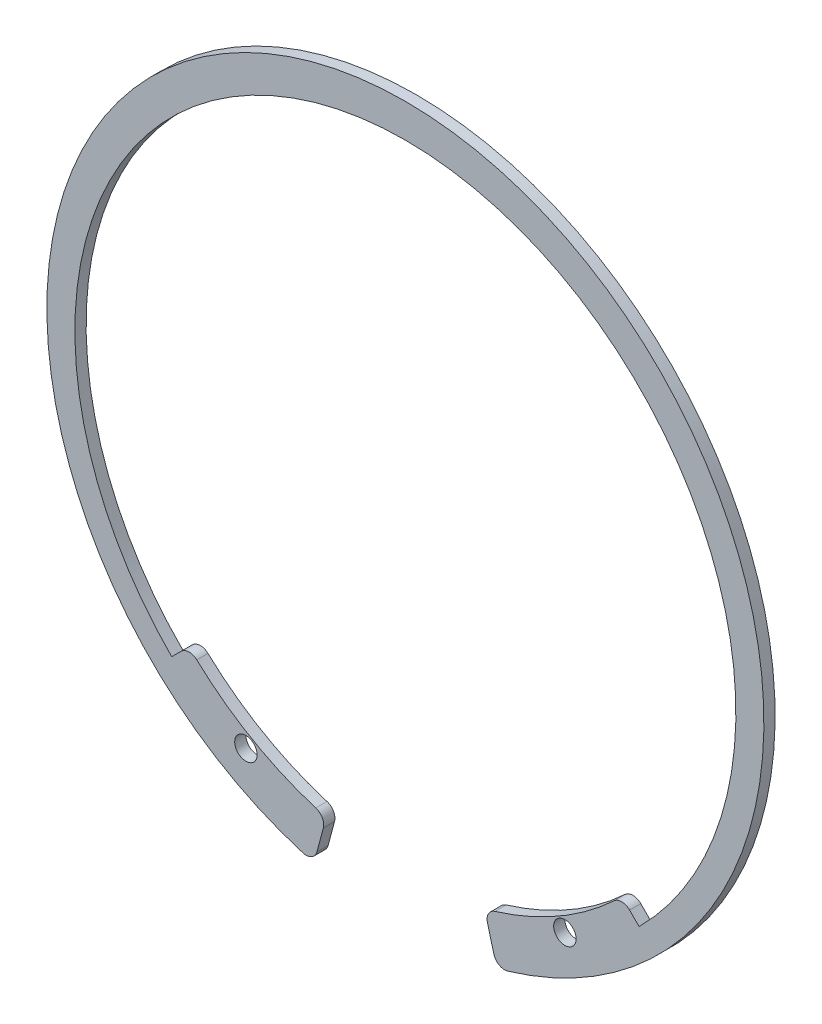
ISO-10303-21;
HEADER;
FILE_DESCRIPTION(('STEP AP214'),'2;1');
FILE_NAME('part.step','',(''),(''),'','','');
FILE_SCHEMA(('AUTOMOTIVE_DESIGN { 1 0 10303 214 1 1 1 1 }'));
ENDSEC;
DATA;
#1=APPLICATION_CONTEXT('core data for automotive mechanical design processes');
#2=APPLICATION_PROTOCOL_DEFINITION('international standard','automotive_design',2000,#1);
#3=PRODUCT_CONTEXT('',#1,'mechanical');
#4=PRODUCT('Part','Part','',(#3));
#5=PRODUCT_RELATED_PRODUCT_CATEGORY('part','',(#4));
#6=PRODUCT_DEFINITION_FORMATION('','',#4);
#7=PRODUCT_DEFINITION_CONTEXT('part definition',#1,'design');
#8=PRODUCT_DEFINITION('design','',#6,#7);
#9=PRODUCT_DEFINITION_SHAPE('','',#8);
#10=(LENGTH_UNIT() NAMED_UNIT(*) SI_UNIT(.MILLI.,.METRE.));
#11=(NAMED_UNIT(*) PLANE_ANGLE_UNIT() SI_UNIT($,.RADIAN.));
#12=(NAMED_UNIT(*) SI_UNIT($,.STERADIAN.) SOLID_ANGLE_UNIT());
#13=UNCERTAINTY_MEASURE_WITH_UNIT(LENGTH_MEASURE(1.E-05),#10,'distance_accuracy_value','');
#14=(GEOMETRIC_REPRESENTATION_CONTEXT(3) GLOBAL_UNCERTAINTY_ASSIGNED_CONTEXT((#13)) GLOBAL_UNIT_ASSIGNED_CONTEXT((#10,
#11,#12)) REPRESENTATION_CONTEXT('',''));
#15=CARTESIAN_POINT('',(0.,0.,0.));
#16=DIRECTION('',(0.,0.,1.));
#17=DIRECTION('',(1.,0.,0.));
#18=AXIS2_PLACEMENT_3D('',#15,#16,#17);
#19=CARTESIAN_POINT('',(19.3033875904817,-20.7176011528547,1.));
#20=DIRECTION('',(0.,0.,-1.));
#21=DIRECTION('',(-1.,0.,0.));
#22=AXIS2_PLACEMENT_3D('',#19,#20,#21);
#23=PLANE('',#22);
#24=CARTESIAN_POINT('',(-14.2347187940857,-24.6298818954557,1.));
#25=DIRECTION('',(0.,0.,1.));
#26=DIRECTION('',(1.,0.,0.));
#27=AXIS2_PLACEMENT_3D('',#24,#25,#26);
#28=CIRCLE('',#27,1.);
#29=CARTESIAN_POINT('',(-13.2347187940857,-24.6298818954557,1.));
#30=VERTEX_POINT('',#29);
#31=EDGE_CURVE('E149',#30,#30,#28,.T.);
#32=ORIENTED_EDGE('',*,*,#31,.F.);
#33=EDGE_LOOP('',(#32));
#34=FACE_BOUND('',#33,.T.);
#35=CARTESIAN_POINT('',(19.3033875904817,-20.7176011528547,1.));
#36=DIRECTION('',(0.,0.,1.));
#37=DIRECTION('',(-1.,0.,0.));
#38=AXIS2_PLACEMENT_3D('',#35,#36,#37);
#39=CIRCLE('',#38,0.999999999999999);
#40=CARTESIAN_POINT('',(20.0104943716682,-20.0104943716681,1.));
#41=VERTEX_POINT('',#40);
#42=CARTESIAN_POINT('',(18.6216931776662,-19.9859641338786,1.));
#43=VERTEX_POINT('',#42);
#44=EDGE_CURVE('E179',#41,#43,#39,.T.);
#45=ORIENTED_EDGE('',*,*,#44,.T.);
#46=CARTESIAN_POINT('',(0.,0.,1.));
#47=DIRECTION('',(0.,0.,-1.));
#48=DIRECTION('',(1.,0.,0.));
#49=AXIS2_PLACEMENT_3D('',#46,#47,#48);
#50=CIRCLE('',#49,27.3167754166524);
#51=CARTESIAN_POINT('',(7.99750607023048,-26.1198414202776,1.));
#52=VERTEX_POINT('',#51);
#53=EDGE_CURVE('E144',#43,#52,#50,.T.);
#54=ORIENTED_EDGE('',*,*,#53,.T.);
#55=CARTESIAN_POINT('',(8.29027510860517,-27.0760246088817,1.));
#56=DIRECTION('',(0.,0.,1.));
#57=DIRECTION('',(-1.,0.,0.));
#58=AXIS2_PLACEMENT_3D('',#55,#56,#57);
#59=CIRCLE('',#58,1.);
#60=CARTESIAN_POINT('',(7.3243492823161,-27.3348436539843,1.));
#61=VERTEX_POINT('',#60);
#62=EDGE_CURVE('E182',#52,#61,#59,.T.);
#63=ORIENTED_EDGE('',*,*,#62,.T.);
#64=DIRECTION('',(0.258819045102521,-0.965925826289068,0.));
#65=VECTOR('',#64,1.);
#66=CARTESIAN_POINT('',(7.8952258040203,-29.4653838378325,1.));
#67=LINE('',#66,#65);
#68=CARTESIAN_POINT('',(7.8952258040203,-29.4653838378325,1.));
#69=VERTEX_POINT('',#68);
#70=EDGE_CURVE('E184',#61,#69,#67,.T.);
#71=ORIENTED_EDGE('',*,*,#70,.T.);
#72=CARTESIAN_POINT('',(8.86115163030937,-29.20656479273,1.));
#73=DIRECTION('',(0.,0.,1.));
#74=DIRECTION('',(-1.,0.,0.));
#75=AXIS2_PLACEMENT_3D('',#72,#73,#74);
#76=CIRCLE('',#75,1.);
#77=CARTESIAN_POINT('',(9.14699523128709,-30.1648410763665,1.));
#78=VERTEX_POINT('',#77);
#79=EDGE_CURVE('E186',#69,#78,#76,.T.);
#80=ORIENTED_EDGE('',*,*,#79,.T.);
#81=CARTESIAN_POINT('',(0.,0.5,1.));
#82=DIRECTION('',(0.,0.,1.));
#83=DIRECTION('',(1.,0.,0.));
#84=AXIS2_PLACEMENT_3D('',#81,#82,#83);
#85=CIRCLE('',#84,32.);
#86=CARTESIAN_POINT('',(-9.14699523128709,-30.1648410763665,1.));
#87=VERTEX_POINT('',#86);
#88=EDGE_CURVE('E188',#78,#87,#85,.T.);
#89=ORIENTED_EDGE('',*,*,#88,.T.);
#90=CARTESIAN_POINT('',(-8.86115163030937,-29.20656479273,1.));
#91=DIRECTION('',(0.,0.,1.));
#92=DIRECTION('',(1.,0.,0.));
#93=AXIS2_PLACEMENT_3D('',#90,#91,#92);
#94=CIRCLE('',#93,1.);
#95=CARTESIAN_POINT('',(-7.8952258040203,-29.4653838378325,1.));
#96=VERTEX_POINT('',#95);
#97=EDGE_CURVE('E190',#87,#96,#94,.T.);
#98=ORIENTED_EDGE('',*,*,#97,.T.);
#99=DIRECTION('',(0.258819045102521,0.965925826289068,0.));
#100=VECTOR('',#99,1.);
#101=CARTESIAN_POINT('',(-7.8952258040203,-29.4653838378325,1.));
#102=LINE('',#101,#100);
#103=CARTESIAN_POINT('',(-7.3243492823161,-27.3348436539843,1.));
#104=VERTEX_POINT('',#103);
#105=EDGE_CURVE('E192',#96,#104,#102,.T.);
#106=ORIENTED_EDGE('',*,*,#105,.T.);
#107=CARTESIAN_POINT('',(-8.29027510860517,-27.0760246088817,1.));
#108=DIRECTION('',(0.,0.,1.));
#109=DIRECTION('',(1.,0.,0.));
#110=AXIS2_PLACEMENT_3D('',#107,#108,#109);
#111=CIRCLE('',#110,1.);
#112=CARTESIAN_POINT('',(-7.99750607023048,-26.1198414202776,1.));
#113=VERTEX_POINT('',#112);
#114=EDGE_CURVE('E194',#104,#113,#111,.T.);
#115=ORIENTED_EDGE('',*,*,#114,.T.);
#116=CARTESIAN_POINT('',(0.,0.,1.));
#117=DIRECTION('',(0.,0.,-1.));
#118=DIRECTION('',(1.,0.,0.));
#119=AXIS2_PLACEMENT_3D('',#116,#117,#118);
#120=CIRCLE('',#119,27.3167754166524);
#121=CARTESIAN_POINT('',(-18.6216931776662,-19.9859641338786,1.));
#122=VERTEX_POINT('',#121);
#123=EDGE_CURVE('E196',#113,#122,#120,.T.);
#124=ORIENTED_EDGE('',*,*,#123,.T.);
#125=CARTESIAN_POINT('',(-19.3033875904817,-20.7176011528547,1.));
#126=DIRECTION('',(0.,0.,1.));
#127=DIRECTION('',(-1.,0.,0.));
#128=AXIS2_PLACEMENT_3D('',#125,#126,#127);
#129=CIRCLE('',#128,1.);
#130=CARTESIAN_POINT('',(-20.0104943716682,-20.0104943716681,1.));
#131=VERTEX_POINT('',#130);
#132=EDGE_CURVE('E198',#122,#131,#129,.T.);
#133=ORIENTED_EDGE('',*,*,#132,.T.);
#134=DIRECTION('',(-0.707106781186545,-0.70710678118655,0.));
#135=VECTOR('',#134,1.);
#136=CARTESIAN_POINT('',(-20.0104943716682,-20.0104943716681,1.));
#137=LINE('',#136,#135);
#138=CARTESIAN_POINT('',(-20.8596500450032,-20.8596500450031,1.));
#139=VERTEX_POINT('',#138);
#140=EDGE_CURVE('E200',#131,#139,#137,.T.);
#141=ORIENTED_EDGE('',*,*,#140,.T.);
#142=CARTESIAN_POINT('',(0.,0.,1.));
#143=DIRECTION('',(0.,0.,-1.));
#144=DIRECTION('',(1.,0.,0.));
#145=AXIS2_PLACEMENT_3D('',#142,#143,#144);
#146=CIRCLE('',#145,29.5);
#147=CARTESIAN_POINT('',(20.8596500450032,-20.8596500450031,1.));
#148=VERTEX_POINT('',#147);
#149=EDGE_CURVE('E49',#139,#148,#146,.T.);
#150=ORIENTED_EDGE('',*,*,#149,.T.);
#151=DIRECTION('',(-0.707106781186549,0.707106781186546,0.));
#152=VECTOR('',#151,1.);
#153=CARTESIAN_POINT('',(20.0104943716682,-20.0104943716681,1.));
#154=LINE('',#153,#152);
#155=EDGE_CURVE('E44',#148,#41,#154,.T.);
#156=ORIENTED_EDGE('',*,*,#155,.T.);
#157=EDGE_LOOP('',(#45,#54,#63,#71,#80,#89,#98,#106,#115,#124,#133,#141,#150,#156));
#158=FACE_BOUND('',#157,.T.);
#159=CARTESIAN_POINT('',(14.2347187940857,-24.6298818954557,1.));
#160=DIRECTION('',(0.,0.,1.));
#161=DIRECTION('',(-1.,0.,0.));
#162=AXIS2_PLACEMENT_3D('',#159,#160,#161);
#163=CIRCLE('',#162,1.);
#164=CARTESIAN_POINT('',(13.2347187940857,-24.6298818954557,1.));
#165=VERTEX_POINT('',#164);
#166=EDGE_CURVE('E319',#165,#165,#163,.T.);
#167=ORIENTED_EDGE('',*,*,#166,.F.);
#168=EDGE_LOOP('',(#167));
#169=FACE_BOUND('',#168,.T.);
#170=ADVANCED_FACE('F29',(#34,#158,#169),#23,.F.);
#171=CARTESIAN_POINT('',(19.3033875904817,-20.7176011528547,0.));
#172=DIRECTION('',(0.,0.,-1.));
#173=DIRECTION('',(-1.,0.,0.));
#174=AXIS2_PLACEMENT_3D('',#171,#172,#173);
#175=PLANE('',#174);
#176=CARTESIAN_POINT('',(-14.2347187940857,-24.6298818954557,0.));
#177=DIRECTION('',(0.,0.,1.));
#178=DIRECTION('',(1.,0.,0.));
#179=AXIS2_PLACEMENT_3D('',#176,#177,#178);
#180=CIRCLE('',#179,1.);
#181=CARTESIAN_POINT('',(-13.2347187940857,-24.6298818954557,0.));
#182=VERTEX_POINT('',#181);
#183=EDGE_CURVE('E152',#182,#182,#180,.T.);
#184=ORIENTED_EDGE('',*,*,#183,.T.);
#185=EDGE_LOOP('',(#184));
#186=FACE_BOUND('',#185,.T.);
#187=CARTESIAN_POINT('',(19.3033875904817,-20.7176011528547,0.));
#188=DIRECTION('',(0.,0.,1.));
#189=DIRECTION('',(-1.,0.,0.));
#190=AXIS2_PLACEMENT_3D('',#187,#188,#189);
#191=CIRCLE('',#190,0.999999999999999);
#192=CARTESIAN_POINT('',(20.0104943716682,-20.0104943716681,0.));
#193=VERTEX_POINT('',#192);
#194=CARTESIAN_POINT('',(18.6216931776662,-19.9859641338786,0.));
#195=VERTEX_POINT('',#194);
#196=EDGE_CURVE('E135',#193,#195,#191,.T.);
#197=ORIENTED_EDGE('',*,*,#196,.F.);
#198=DIRECTION('',(-0.707106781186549,0.707106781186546,0.));
#199=VECTOR('',#198,1.);
#200=CARTESIAN_POINT('',(20.0104943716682,-20.0104943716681,0.));
#201=LINE('',#200,#199);
#202=CARTESIAN_POINT('',(20.8596500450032,-20.8596500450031,0.));
#203=VERTEX_POINT('',#202);
#204=EDGE_CURVE('E177',#203,#193,#201,.T.);
#205=ORIENTED_EDGE('',*,*,#204,.F.);
#206=CARTESIAN_POINT('',(0.,0.,0.));
#207=DIRECTION('',(0.,0.,-1.));
#208=DIRECTION('',(1.,0.,0.));
#209=AXIS2_PLACEMENT_3D('',#206,#207,#208);
#210=CIRCLE('',#209,29.5);
#211=CARTESIAN_POINT('',(-20.8596500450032,-20.8596500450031,0.));
#212=VERTEX_POINT('',#211);
#213=EDGE_CURVE('E175',#212,#203,#210,.T.);
#214=ORIENTED_EDGE('',*,*,#213,.F.);
#215=DIRECTION('',(-0.707106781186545,-0.70710678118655,0.));
#216=VECTOR('',#215,1.);
#217=CARTESIAN_POINT('',(-20.0104943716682,-20.0104943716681,0.));
#218=LINE('',#217,#216);
#219=CARTESIAN_POINT('',(-20.0104943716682,-20.0104943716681,0.));
#220=VERTEX_POINT('',#219);
#221=EDGE_CURVE('E173',#220,#212,#218,.T.);
#222=ORIENTED_EDGE('',*,*,#221,.F.);
#223=CARTESIAN_POINT('',(-19.3033875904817,-20.7176011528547,0.));
#224=DIRECTION('',(0.,0.,1.));
#225=DIRECTION('',(-1.,0.,0.));
#226=AXIS2_PLACEMENT_3D('',#223,#224,#225);
#227=CIRCLE('',#226,1.);
#228=CARTESIAN_POINT('',(-18.6216931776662,-19.9859641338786,0.));
#229=VERTEX_POINT('',#228);
#230=EDGE_CURVE('E171',#229,#220,#227,.T.);
#231=ORIENTED_EDGE('',*,*,#230,.F.);
#232=CARTESIAN_POINT('',(0.,0.,0.));
#233=DIRECTION('',(0.,0.,-1.));
#234=DIRECTION('',(1.,0.,0.));
#235=AXIS2_PLACEMENT_3D('',#232,#233,#234);
#236=CIRCLE('',#235,27.3167754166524);
#237=CARTESIAN_POINT('',(-7.99750607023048,-26.1198414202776,0.));
#238=VERTEX_POINT('',#237);
#239=EDGE_CURVE('E169',#238,#229,#236,.T.);
#240=ORIENTED_EDGE('',*,*,#239,.F.);
#241=CARTESIAN_POINT('',(-8.29027510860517,-27.0760246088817,0.));
#242=DIRECTION('',(0.,0.,1.));
#243=DIRECTION('',(1.,0.,0.));
#244=AXIS2_PLACEMENT_3D('',#241,#242,#243);
#245=CIRCLE('',#244,1.);
#246=CARTESIAN_POINT('',(-7.3243492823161,-27.3348436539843,0.));
#247=VERTEX_POINT('',#246);
#248=EDGE_CURVE('E167',#247,#238,#245,.T.);
#249=ORIENTED_EDGE('',*,*,#248,.F.);
#250=DIRECTION('',(0.258819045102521,0.965925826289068,0.));
#251=VECTOR('',#250,1.);
#252=CARTESIAN_POINT('',(-7.8952258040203,-29.4653838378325,0.));
#253=LINE('',#252,#251);
#254=CARTESIAN_POINT('',(-7.8952258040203,-29.4653838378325,0.));
#255=VERTEX_POINT('',#254);
#256=EDGE_CURVE('E165',#255,#247,#253,.T.);
#257=ORIENTED_EDGE('',*,*,#256,.F.);
#258=CARTESIAN_POINT('',(-8.86115163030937,-29.20656479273,0.));
#259=DIRECTION('',(0.,0.,1.));
#260=DIRECTION('',(1.,0.,0.));
#261=AXIS2_PLACEMENT_3D('',#258,#259,#260);
#262=CIRCLE('',#261,1.);
#263=CARTESIAN_POINT('',(-9.14699523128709,-30.1648410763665,0.));
#264=VERTEX_POINT('',#263);
#265=EDGE_CURVE('E163',#264,#255,#262,.T.);
#266=ORIENTED_EDGE('',*,*,#265,.F.);
#267=CARTESIAN_POINT('',(0.,0.5,0.));
#268=DIRECTION('',(0.,0.,1.));
#269=DIRECTION('',(1.,0.,0.));
#270=AXIS2_PLACEMENT_3D('',#267,#268,#269);
#271=CIRCLE('',#270,32.);
#272=CARTESIAN_POINT('',(9.14699523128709,-30.1648410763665,0.));
#273=VERTEX_POINT('',#272);
#274=EDGE_CURVE('E161',#273,#264,#271,.T.);
#275=ORIENTED_EDGE('',*,*,#274,.F.);
#276=CARTESIAN_POINT('',(8.86115163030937,-29.20656479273,0.));
#277=DIRECTION('',(0.,0.,1.));
#278=DIRECTION('',(-1.,0.,0.));
#279=AXIS2_PLACEMENT_3D('',#276,#277,#278);
#280=CIRCLE('',#279,1.);
#281=CARTESIAN_POINT('',(7.8952258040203,-29.4653838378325,0.));
#282=VERTEX_POINT('',#281);
#283=EDGE_CURVE('E159',#282,#273,#280,.T.);
#284=ORIENTED_EDGE('',*,*,#283,.F.);
#285=DIRECTION('',(0.258819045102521,-0.965925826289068,0.));
#286=VECTOR('',#285,1.);
#287=CARTESIAN_POINT('',(7.8952258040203,-29.4653838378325,0.));
#288=LINE('',#287,#286);
#289=CARTESIAN_POINT('',(7.3243492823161,-27.3348436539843,0.));
#290=VERTEX_POINT('',#289);
#291=EDGE_CURVE('E157',#290,#282,#288,.T.);
#292=ORIENTED_EDGE('',*,*,#291,.F.);
#293=CARTESIAN_POINT('',(8.29027510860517,-27.0760246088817,0.));
#294=DIRECTION('',(0.,0.,1.));
#295=DIRECTION('',(-1.,0.,0.));
#296=AXIS2_PLACEMENT_3D('',#293,#294,#295);
#297=CIRCLE('',#296,1.);
#298=CARTESIAN_POINT('',(7.99750607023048,-26.1198414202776,0.));
#299=VERTEX_POINT('',#298);
#300=EDGE_CURVE('E137',#299,#290,#297,.T.);
#301=ORIENTED_EDGE('',*,*,#300,.F.);
#302=CARTESIAN_POINT('',(0.,0.,0.));
#303=DIRECTION('',(0.,0.,-1.));
#304=DIRECTION('',(1.,0.,0.));
#305=AXIS2_PLACEMENT_3D('',#302,#303,#304);
#306=CIRCLE('',#305,27.3167754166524);
#307=EDGE_CURVE('E130',#195,#299,#306,.T.);
#308=ORIENTED_EDGE('',*,*,#307,.F.);
#309=EDGE_LOOP('',(#197,#205,#214,#222,#231,#240,#249,#257,#266,#275,#284,#292,#301,#308));
#310=FACE_BOUND('',#309,.T.);
#311=CARTESIAN_POINT('',(14.2347187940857,-24.6298818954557,0.));
#312=DIRECTION('',(0.,0.,1.));
#313=DIRECTION('',(-1.,0.,0.));
#314=AXIS2_PLACEMENT_3D('',#311,#312,#313);
#315=CIRCLE('',#314,1.);
#316=CARTESIAN_POINT('',(13.2347187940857,-24.6298818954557,0.));
#317=VERTEX_POINT('',#316);
#318=EDGE_CURVE('E322',#317,#317,#315,.T.);
#319=ORIENTED_EDGE('',*,*,#318,.T.);
#320=EDGE_LOOP('',(#319));
#321=FACE_BOUND('',#320,.T.);
#322=ADVANCED_FACE('F131',(#186,#310,#321),#175,.T.);
#323=CARTESIAN_POINT('',(19.3033875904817,-20.7176011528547,1.));
#324=DIRECTION('',(0.,0.,-1.));
#325=DIRECTION('',(-1.,0.,0.));
#326=AXIS2_PLACEMENT_3D('',#323,#324,#325);
#327=CYLINDRICAL_SURFACE('',#326,0.999999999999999);
#328=ORIENTED_EDGE('',*,*,#196,.T.);
#329=DIRECTION('',(0.,0.,-1.));
#330=VECTOR('',#329,1.);
#331=CARTESIAN_POINT('',(18.6216931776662,-19.9859641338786,1.));
#332=LINE('',#331,#330);
#333=EDGE_CURVE('E11',#43,#195,#332,.T.);
#334=ORIENTED_EDGE('',*,*,#333,.F.);
#335=ORIENTED_EDGE('',*,*,#44,.F.);
#336=DIRECTION('',(0.,0.,-1.));
#337=VECTOR('',#336,1.);
#338=CARTESIAN_POINT('',(20.0104943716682,-20.0104943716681,1.));
#339=LINE('',#338,#337);
#340=EDGE_CURVE('E148',#41,#193,#339,.T.);
#341=ORIENTED_EDGE('',*,*,#340,.T.);
#342=EDGE_LOOP('',(#328,#334,#335,#341));
#343=FACE_BOUND('',#342,.T.);
#344=ADVANCED_FACE('F31',(#343),#327,.T.);
#345=CARTESIAN_POINT('',(0.,0.,1.));
#346=DIRECTION('',(0.,0.,-1.));
#347=DIRECTION('',(-1.,0.,0.));
#348=AXIS2_PLACEMENT_3D('',#345,#346,#347);
#349=CYLINDRICAL_SURFACE('',#348,27.3167754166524);
#350=ORIENTED_EDGE('',*,*,#307,.T.);
#351=DIRECTION('',(0.,0.,-1.));
#352=VECTOR('',#351,1.);
#353=CARTESIAN_POINT('',(7.99750607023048,-26.1198414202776,1.));
#354=LINE('',#353,#352);
#355=EDGE_CURVE('E37',#52,#299,#354,.T.);
#356=ORIENTED_EDGE('',*,*,#355,.F.);
#357=ORIENTED_EDGE('',*,*,#53,.F.);
#358=ORIENTED_EDGE('',*,*,#333,.T.);
#359=EDGE_LOOP('',(#350,#356,#357,#358));
#360=FACE_BOUND('',#359,.T.);
#361=ADVANCED_FACE('F143',(#360),#349,.F.);
#362=CARTESIAN_POINT('',(8.29027510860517,-27.0760246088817,1.));
#363=DIRECTION('',(0.,0.,-1.));
#364=DIRECTION('',(-1.,0.,0.));
#365=AXIS2_PLACEMENT_3D('',#362,#363,#364);
#366=CYLINDRICAL_SURFACE('',#365,1.);
#367=ORIENTED_EDGE('',*,*,#300,.T.);
#368=DIRECTION('',(0.,0.,-1.));
#369=VECTOR('',#368,1.);
#370=CARTESIAN_POINT('',(7.3243492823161,-27.3348436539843,1.));
#371=LINE('',#370,#369);
#372=EDGE_CURVE('E235',#61,#290,#371,.T.);
#373=ORIENTED_EDGE('',*,*,#372,.F.);
#374=ORIENTED_EDGE('',*,*,#62,.F.);
#375=ORIENTED_EDGE('',*,*,#355,.T.);
#376=EDGE_LOOP('',(#367,#373,#374,#375));
#377=FACE_BOUND('',#376,.T.);
#378=ADVANCED_FACE('F239',(#377),#366,.T.);
#379=CARTESIAN_POINT('',(7.8952258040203,-29.4653838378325,1.));
#380=DIRECTION('',(0.965925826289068,0.258819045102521,0.));
#381=DIRECTION('',(-0.258819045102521,0.965925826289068,0.));
#382=AXIS2_PLACEMENT_3D('',#379,#380,#381);
#383=PLANE('',#382);
#384=ORIENTED_EDGE('',*,*,#291,.T.);
#385=DIRECTION('',(0.,0.,-1.));
#386=VECTOR('',#385,1.);
#387=CARTESIAN_POINT('',(7.8952258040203,-29.4653838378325,1.));
#388=LINE('',#387,#386);
#389=EDGE_CURVE('E232',#69,#282,#388,.T.);
#390=ORIENTED_EDGE('',*,*,#389,.F.);
#391=ORIENTED_EDGE('',*,*,#70,.F.);
#392=ORIENTED_EDGE('',*,*,#372,.T.);
#393=EDGE_LOOP('',(#384,#390,#391,#392));
#394=FACE_BOUND('',#393,.T.);
#395=ADVANCED_FACE('F247',(#394),#383,.F.);
#396=CARTESIAN_POINT('',(8.86115163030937,-29.20656479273,1.));
#397=DIRECTION('',(0.,0.,-1.));
#398=DIRECTION('',(-1.,0.,0.));
#399=AXIS2_PLACEMENT_3D('',#396,#397,#398);
#400=CYLINDRICAL_SURFACE('',#399,1.);
#401=ORIENTED_EDGE('',*,*,#283,.T.);
#402=DIRECTION('',(0.,0.,-1.));
#403=VECTOR('',#402,1.);
#404=CARTESIAN_POINT('',(9.14699523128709,-30.1648410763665,1.));
#405=LINE('',#404,#403);
#406=EDGE_CURVE('E229',#78,#273,#405,.T.);
#407=ORIENTED_EDGE('',*,*,#406,.F.);
#408=ORIENTED_EDGE('',*,*,#79,.F.);
#409=ORIENTED_EDGE('',*,*,#389,.T.);
#410=EDGE_LOOP('',(#401,#407,#408,#409));
#411=FACE_BOUND('',#410,.T.);
#412=ADVANCED_FACE('F250',(#411),#400,.T.);
#413=CARTESIAN_POINT('',(0.,0.5,1.));
#414=DIRECTION('',(0.,0.,-1.));
#415=DIRECTION('',(-1.,0.,0.));
#416=AXIS2_PLACEMENT_3D('',#413,#414,#415);
#417=CYLINDRICAL_SURFACE('',#416,32.);
#418=ORIENTED_EDGE('',*,*,#274,.T.);
#419=DIRECTION('',(0.,0.,-1.));
#420=VECTOR('',#419,1.);
#421=CARTESIAN_POINT('',(-9.14699523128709,-30.1648410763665,1.));
#422=LINE('',#421,#420);
#423=EDGE_CURVE('E226',#87,#264,#422,.T.);
#424=ORIENTED_EDGE('',*,*,#423,.F.);
#425=ORIENTED_EDGE('',*,*,#88,.F.);
#426=ORIENTED_EDGE('',*,*,#406,.T.);
#427=EDGE_LOOP('',(#418,#424,#425,#426));
#428=FACE_BOUND('',#427,.T.);
#429=ADVANCED_FACE('F255',(#428),#417,.T.);
#430=CARTESIAN_POINT('',(-8.86115163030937,-29.20656479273,1.));
#431=DIRECTION('',(0.,0.,-1.));
#432=DIRECTION('',(-1.,0.,0.));
#433=AXIS2_PLACEMENT_3D('',#430,#431,#432);
#434=CYLINDRICAL_SURFACE('',#433,1.);
#435=ORIENTED_EDGE('',*,*,#265,.T.);
#436=DIRECTION('',(0.,0.,-1.));
#437=VECTOR('',#436,1.);
#438=CARTESIAN_POINT('',(-7.8952258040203,-29.4653838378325,1.));
#439=LINE('',#438,#437);
#440=EDGE_CURVE('E223',#96,#255,#439,.T.);
#441=ORIENTED_EDGE('',*,*,#440,.F.);
#442=ORIENTED_EDGE('',*,*,#97,.F.);
#443=ORIENTED_EDGE('',*,*,#423,.T.);
#444=EDGE_LOOP('',(#435,#441,#442,#443));
#445=FACE_BOUND('',#444,.T.);
#446=ADVANCED_FACE('F261',(#445),#434,.T.);
#447=CARTESIAN_POINT('',(-7.8952258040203,-29.4653838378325,1.));
#448=DIRECTION('',(-0.965925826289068,0.258819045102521,0.));
#449=DIRECTION('',(-0.258819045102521,-0.965925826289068,0.));
#450=AXIS2_PLACEMENT_3D('',#447,#448,#449);
#451=PLANE('',#450);
#452=ORIENTED_EDGE('',*,*,#256,.T.);
#453=DIRECTION('',(0.,0.,-1.));
#454=VECTOR('',#453,1.);
#455=CARTESIAN_POINT('',(-7.3243492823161,-27.3348436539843,1.));
#456=LINE('',#455,#454);
#457=EDGE_CURVE('E220',#104,#247,#456,.T.);
#458=ORIENTED_EDGE('',*,*,#457,.F.);
#459=ORIENTED_EDGE('',*,*,#105,.F.);
#460=ORIENTED_EDGE('',*,*,#440,.T.);
#461=EDGE_LOOP('',(#452,#458,#459,#460));
#462=FACE_BOUND('',#461,.T.);
#463=ADVANCED_FACE('F265',(#462),#451,.F.);
#464=CARTESIAN_POINT('',(-8.29027510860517,-27.0760246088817,1.));
#465=DIRECTION('',(0.,0.,-1.));
#466=DIRECTION('',(-1.,0.,0.));
#467=AXIS2_PLACEMENT_3D('',#464,#465,#466);
#468=CYLINDRICAL_SURFACE('',#467,1.);
#469=ORIENTED_EDGE('',*,*,#248,.T.);
#470=DIRECTION('',(0.,0.,-1.));
#471=VECTOR('',#470,1.);
#472=CARTESIAN_POINT('',(-7.99750607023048,-26.1198414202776,1.));
#473=LINE('',#472,#471);
#474=EDGE_CURVE('E217',#113,#238,#473,.T.);
#475=ORIENTED_EDGE('',*,*,#474,.F.);
#476=ORIENTED_EDGE('',*,*,#114,.F.);
#477=ORIENTED_EDGE('',*,*,#457,.T.);
#478=EDGE_LOOP('',(#469,#475,#476,#477));
#479=FACE_BOUND('',#478,.T.);
#480=ADVANCED_FACE('F270',(#479),#468,.T.);
#481=CARTESIAN_POINT('',(0.,0.,1.));
#482=DIRECTION('',(0.,0.,-1.));
#483=DIRECTION('',(-1.,0.,0.));
#484=AXIS2_PLACEMENT_3D('',#481,#482,#483);
#485=CYLINDRICAL_SURFACE('',#484,27.3167754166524);
#486=ORIENTED_EDGE('',*,*,#239,.T.);
#487=DIRECTION('',(0.,0.,-1.));
#488=VECTOR('',#487,1.);
#489=CARTESIAN_POINT('',(-18.6216931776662,-19.9859641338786,1.));
#490=LINE('',#489,#488);
#491=EDGE_CURVE('E214',#122,#229,#490,.T.);
#492=ORIENTED_EDGE('',*,*,#491,.F.);
#493=ORIENTED_EDGE('',*,*,#123,.F.);
#494=ORIENTED_EDGE('',*,*,#474,.T.);
#495=EDGE_LOOP('',(#486,#492,#493,#494));
#496=FACE_BOUND('',#495,.T.);
#497=ADVANCED_FACE('F276',(#496),#485,.F.);
#498=CARTESIAN_POINT('',(-19.3033875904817,-20.7176011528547,1.));
#499=DIRECTION('',(0.,0.,-1.));
#500=DIRECTION('',(-1.,0.,0.));
#501=AXIS2_PLACEMENT_3D('',#498,#499,#500);
#502=CYLINDRICAL_SURFACE('',#501,1.);
#503=ORIENTED_EDGE('',*,*,#230,.T.);
#504=DIRECTION('',(0.,0.,-1.));
#505=VECTOR('',#504,1.);
#506=CARTESIAN_POINT('',(-20.0104943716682,-20.0104943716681,1.));
#507=LINE('',#506,#505);
#508=EDGE_CURVE('E211',#131,#220,#507,.T.);
#509=ORIENTED_EDGE('',*,*,#508,.F.);
#510=ORIENTED_EDGE('',*,*,#132,.F.);
#511=ORIENTED_EDGE('',*,*,#491,.T.);
#512=EDGE_LOOP('',(#503,#509,#510,#511));
#513=FACE_BOUND('',#512,.T.);
#514=ADVANCED_FACE('F280',(#513),#502,.T.);
#515=CARTESIAN_POINT('',(-20.0104943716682,-20.0104943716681,1.));
#516=DIRECTION('',(0.70710678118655,-0.707106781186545,0.));
#517=DIRECTION('',(0.707106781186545,0.70710678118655,0.));
#518=AXIS2_PLACEMENT_3D('',#515,#516,#517);
#519=PLANE('',#518);
#520=ORIENTED_EDGE('',*,*,#221,.T.);
#521=DIRECTION('',(0.,0.,-1.));
#522=VECTOR('',#521,1.);
#523=CARTESIAN_POINT('',(-20.8596500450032,-20.8596500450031,1.));
#524=LINE('',#523,#522);
#525=EDGE_CURVE('E208',#139,#212,#524,.T.);
#526=ORIENTED_EDGE('',*,*,#525,.F.);
#527=ORIENTED_EDGE('',*,*,#140,.F.);
#528=ORIENTED_EDGE('',*,*,#508,.T.);
#529=EDGE_LOOP('',(#520,#526,#527,#528));
#530=FACE_BOUND('',#529,.T.);
#531=ADVANCED_FACE('F285',(#530),#519,.F.);
#532=CARTESIAN_POINT('',(0.,0.,1.));
#533=DIRECTION('',(0.,0.,-1.));
#534=DIRECTION('',(-1.,0.,0.));
#535=AXIS2_PLACEMENT_3D('',#532,#533,#534);
#536=CYLINDRICAL_SURFACE('',#535,29.5);
#537=ORIENTED_EDGE('',*,*,#213,.T.);
#538=DIRECTION('',(0.,0.,-1.));
#539=VECTOR('',#538,1.);
#540=CARTESIAN_POINT('',(20.8596500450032,-20.8596500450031,1.));
#541=LINE('',#540,#539);
#542=EDGE_CURVE('E205',#148,#203,#541,.T.);
#543=ORIENTED_EDGE('',*,*,#542,.F.);
#544=ORIENTED_EDGE('',*,*,#149,.F.);
#545=ORIENTED_EDGE('',*,*,#525,.T.);
#546=EDGE_LOOP('',(#537,#543,#544,#545));
#547=FACE_BOUND('',#546,.T.);
#548=ADVANCED_FACE('F288',(#547),#536,.F.);
#549=CARTESIAN_POINT('',(20.0104943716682,-20.0104943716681,1.));
#550=DIRECTION('',(-0.707106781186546,-0.707106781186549,0.));
#551=DIRECTION('',(0.707106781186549,-0.707106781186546,0.));
#552=AXIS2_PLACEMENT_3D('',#549,#550,#551);
#553=PLANE('',#552);
#554=ORIENTED_EDGE('',*,*,#204,.T.);
#555=ORIENTED_EDGE('',*,*,#340,.F.);
#556=ORIENTED_EDGE('',*,*,#155,.F.);
#557=ORIENTED_EDGE('',*,*,#542,.T.);
#558=EDGE_LOOP('',(#554,#555,#556,#557));
#559=FACE_BOUND('',#558,.T.);
#560=ADVANCED_FACE('F290',(#559),#553,.F.);
#561=CARTESIAN_POINT('',(-14.2347187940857,-24.6298818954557,1.));
#562=DIRECTION('',(0.,0.,-1.));
#563=DIRECTION('',(-1.,0.,0.));
#564=AXIS2_PLACEMENT_3D('',#561,#562,#563);
#565=CYLINDRICAL_SURFACE('',#564,1.);
#566=ORIENTED_EDGE('',*,*,#31,.T.);
#567=EDGE_LOOP('',(#566));
#568=FACE_BOUND('',#567,.T.);
#569=ORIENTED_EDGE('',*,*,#183,.F.);
#570=EDGE_LOOP('',(#569));
#571=FACE_BOUND('',#570,.T.);
#572=ADVANCED_FACE('F292',(#568,#571),#565,.F.);
#573=CARTESIAN_POINT('',(14.2347187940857,-24.6298818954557,1.));
#574=DIRECTION('',(0.,0.,-1.));
#575=DIRECTION('',(-1.,0.,0.));
#576=AXIS2_PLACEMENT_3D('',#573,#574,#575);
#577=CYLINDRICAL_SURFACE('',#576,1.);
#578=ORIENTED_EDGE('',*,*,#166,.T.);
#579=EDGE_LOOP('',(#578));
#580=FACE_BOUND('',#579,.T.);
#581=ORIENTED_EDGE('',*,*,#318,.F.);
#582=EDGE_LOOP('',(#581));
#583=FACE_BOUND('',#582,.T.);
#584=ADVANCED_FACE('F298',(#580,#583),#577,.F.);
#585=CLOSED_SHELL('',(#170,#322,#344,#361,#378,#395,#412,#429,#446,#463,#480,#497,#514,#531,
#548,#560,#572,#584));
#586=MANIFOLD_SOLID_BREP('B2',#585);
#587=ADVANCED_BREP_SHAPE_REPRESENTATION('',(#18,#586),#14);
#588=SHAPE_DEFINITION_REPRESENTATION(#9,#587);
ENDSEC;
END-ISO-10303-21;
